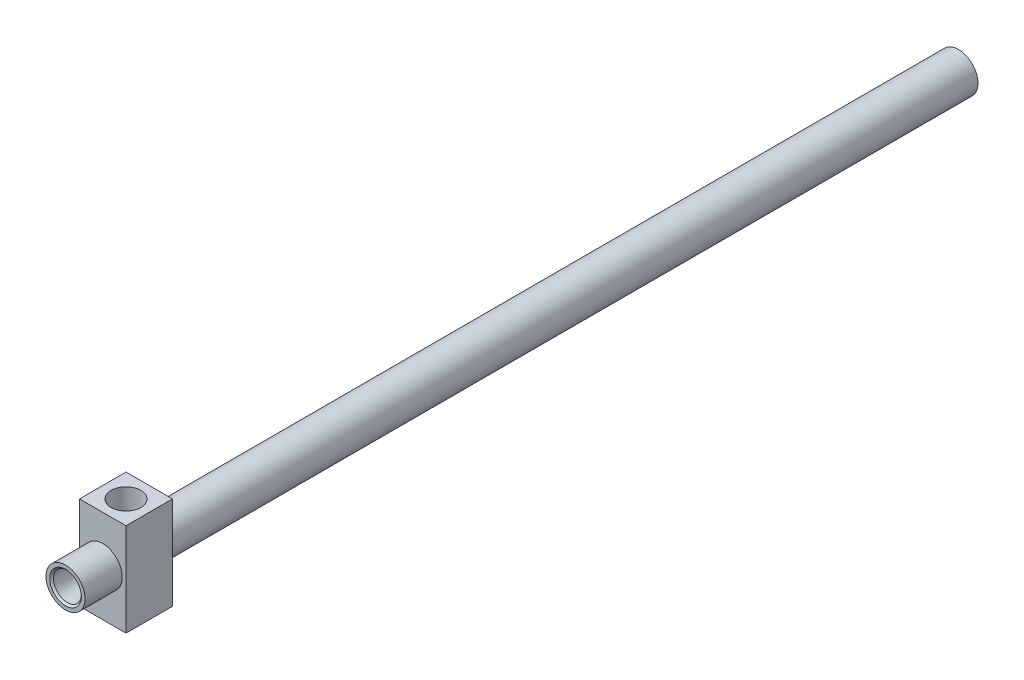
from build123d import *

# Parameters (mm, degrees)
ESQUISSE1_R             = 10.5
BASE_EXTRUSION_DEPTH    = 435
ESQUISSE2_W             = 25
ESQUISSE2_H             = 25
BOSS_EXTRU_1_DEPTH      = 25
ESQUISSE3_R             = 8
ENL_V_MAT_EXTRU_1_DEPTH = 14.5
ENL_V_START             = -14.5
ESQUISSE6_R             = 8
ENL_V_MAT_EXTRU_4_DEPTH = 14.5
ESQUISSE7_R             = 5
ENL_V_MAT_EXTRU_5_DEPTH = 439.042520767
BOSS_EXTRU_2_START      = 20
ESQUISSE4_R             = 10.5
BOSS_EXTRU_2_DEPTH      = 20
ESQUISSE5_R             = 7.5
ENL_V_MAT_EXTRU_2_DEPTH = 481.813113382
CHANFREIN1_SIZE         = 1


with BuildPart() as part:
    # Esquisse1 → Base-Extrusion (new body)
    with BuildSketch(Plane.XY):
        Circle(ESQUISSE1_R)
    extrude(amount=-BASE_EXTRUSION_DEPTH)

    # Esquisse2 → Boss.-Extru.1 (add, symmetric)
    with BuildSketch(Plane(origin=(0, 0, 0), x_dir=(1, 0, 0), z_dir=(0, 1, 0))):
        with Locations((0, -12.5)):
            Rectangle(ESQUISSE2_W, ESQUISSE2_H)
    extrude(amount=BOSS_EXTRU_1_DEPTH, both=True)

    # Esquisse3 → Enl_v. mat.-Extru.1 (cut)
    with BuildSketch(Plane(origin=(0, 25, 0), x_dir=(-1, 0, 0), z_dir=(0, 1, 0))):
        with Locations(Location((0, 12.5, 0), (0, 0, 90))):
            Circle(ESQUISSE3_R)
    extrude(amount=-ENL_V_MAT_EXTRU_1_DEPTH, mode=Mode.SUBTRACT)

    # Esquisse6 → Enl_v. mat.-Extru.4 (cut)
    with BuildSketch(Plane.XZ.offset(25).offset(ENL_V_START)):
        with Locations(Location((0, 12.5, 0), (0, 0, 90))):
            Circle(ESQUISSE6_R)
    extrude(amount=ENL_V_MAT_EXTRU_4_DEPTH, mode=Mode.SUBTRACT)

    # Esquisse7 → Enl_v. mat.-Extru.5 (cut, through all)
    with BuildSketch(Plane.XZ.offset(25)):
        with Locations(Location((0, 12.5, 0), (0, 0, 270))):
            Circle(ESQUISSE7_R)
    extrude(amount=-ENL_V_MAT_EXTRU_5_DEPTH, mode=Mode.SUBTRACT)

    # Esquisse4 → Boss.-Extru.2 (add)
    with BuildSketch(Plane.XY.offset(25).offset(BOSS_EXTRU_2_START)):
        Circle(ESQUISSE4_R)
    extrude(amount=-BOSS_EXTRU_2_DEPTH)

    # Esquisse5 → Enl_v. mat.-Extru.2 (cut, through all)
    with BuildSketch(Plane.XY.offset(45)):
        Circle(ESQUISSE5_R)
    extrude(amount=-ENL_V_MAT_EXTRU_2_DEPTH, mode=Mode.SUBTRACT)

    # Chanfrein1
    chanfrein1_edges = [part.edges().sort_by_distance(p)[0] for p in [
        (-7.5, 0, -435),
        (-7.5, 0, 45),
    ]]
    chamfer(chanfrein1_edges, length=CHANFREIN1_SIZE)


solid = part.part
